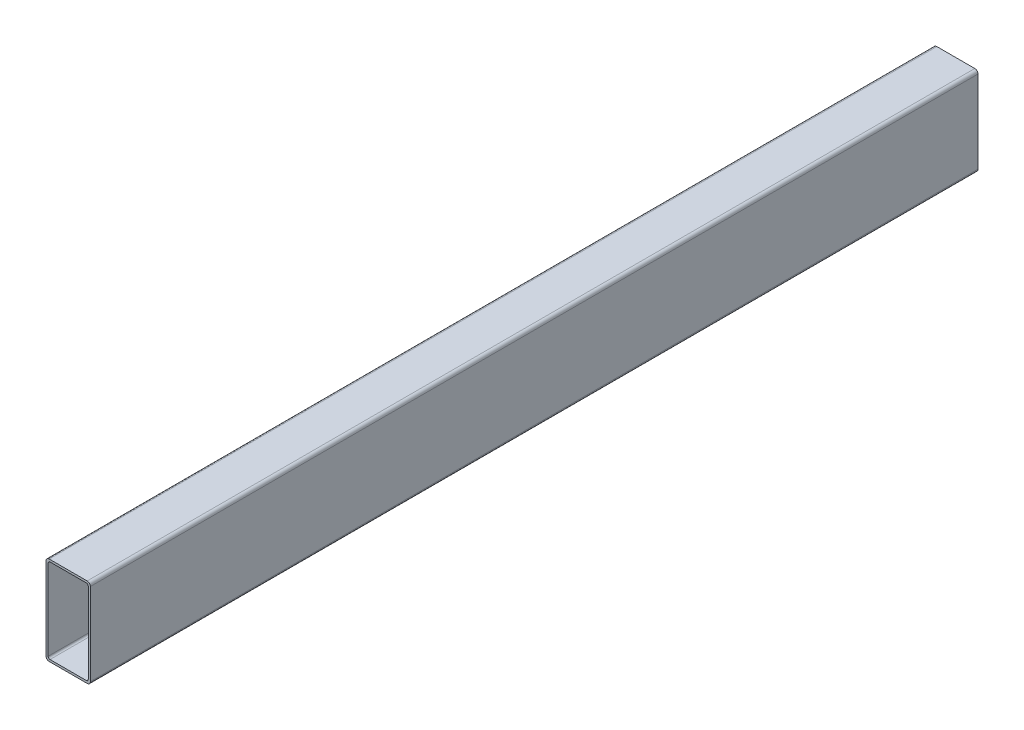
from build123d import *

# Parameters (mm, degrees)
EXTRUDE_1_DEPTH = 500


with BuildPart() as part:
    # Sketch 1 → Extrude 1 (new body)
    with BuildSketch(Plane.XY):
        with BuildLine():
            Line((-10.704, 25), (10.704, 25))
            ThreePointArc((10.704, 25), (11.973963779, 24.473963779), (12.5, 23.204))
            Line((12.5, 23.204), (12.5, -23.204))
            ThreePointArc((12.5, -23.204), (11.973963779, -24.473963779), (10.704, -25))
            Line((10.704, -25), (-10.704, -25))
            ThreePointArc((-10.704, -25), (-11.973963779, -24.473963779), (-12.5, -23.204))
            Line((-12.5, -23.204), (-12.5, 23.204))
            ThreePointArc((-12.5, 23.204), (-11.973963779, 24.473963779), (-10.704, 25))
        make_face()
        with BuildLine():
            Line((-10.252, 23.8), (10.252, 23.8))
            ThreePointArc((10.252, 23.8), (10.993047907, 23.493047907), (11.3, 22.752))
            Line((11.3, 22.752), (11.3, -22.752))
            ThreePointArc((11.3, -22.752), (10.993047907, -23.493047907), (10.252, -23.8))
            Line((10.252, -23.8), (-10.252, -23.8))
            ThreePointArc((-10.252, -23.8), (-10.993047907, -23.493047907), (-11.3, -22.752))
            Line((-11.3, -22.752), (-11.3, 22.752))
            ThreePointArc((-11.3, 22.752), (-10.993047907, 23.493047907), (-10.252, 23.8))
        make_face(mode=Mode.SUBTRACT)
    extrude(amount=EXTRUDE_1_DEPTH)


solid = part.part
